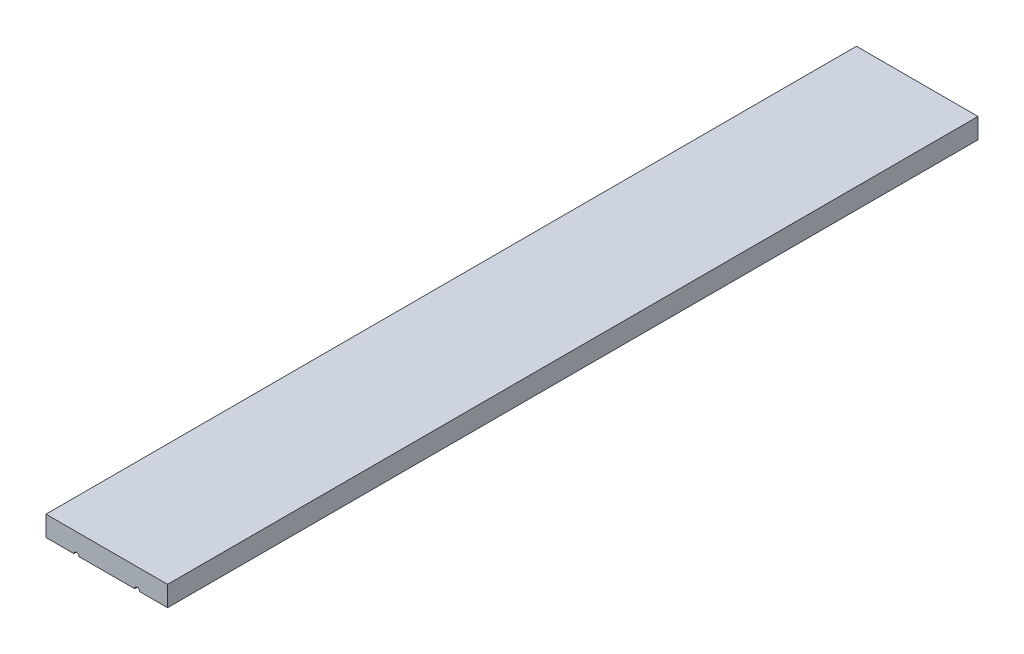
from build123d import *

# Parameters (mm, degrees)
SKETCH1_W           = 152.4
SKETCH1_H           = 25.4
BOSS_EXTRUDE1_DEPTH = 1016
SKETCH2_R           = 3.175
CUT_EXTRUDE1_DEPTH  = 38.1
CUT_EXTRUDE2_START  = -977.9
SKETCH2_2_R         = 3.175
CUT_EXTRUDE2_DEPTH  = 38.1


with BuildPart() as part:
    # Sketch1 → Boss-Extrude1 (new body)
    with BuildSketch(Plane.XY):
        with Locations((6.679427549, 29.69391771)):
            Rectangle(SKETCH1_W, SKETCH1_H)
    extrude(amount=BOSS_EXTRUDE1_DEPTH)

    # Sketch2 → Cut-Extrude1 (cut)
    with BuildSketch(Plane.XY.offset(1016)):
        with Locations((-31.420572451, 16.99391771)):
            Circle(SKETCH2_R)
        with Locations((44.779427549, 16.99391771)):
            Circle(SKETCH2_R)
    extrude(amount=-CUT_EXTRUDE1_DEPTH, mode=Mode.SUBTRACT)

    # Sketch2_2 → Cut-Extrude2 (cut)
    with BuildSketch(Plane.XY.offset(1016).offset(CUT_EXTRUDE2_START)):
        with Locations((-31.420572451, 16.99391771)):
            Circle(SKETCH2_2_R)
        with Locations((44.779427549, 16.99391771)):
            Circle(SKETCH2_2_R)
    extrude(amount=-CUT_EXTRUDE2_DEPTH, mode=Mode.SUBTRACT)


solid = part.part
